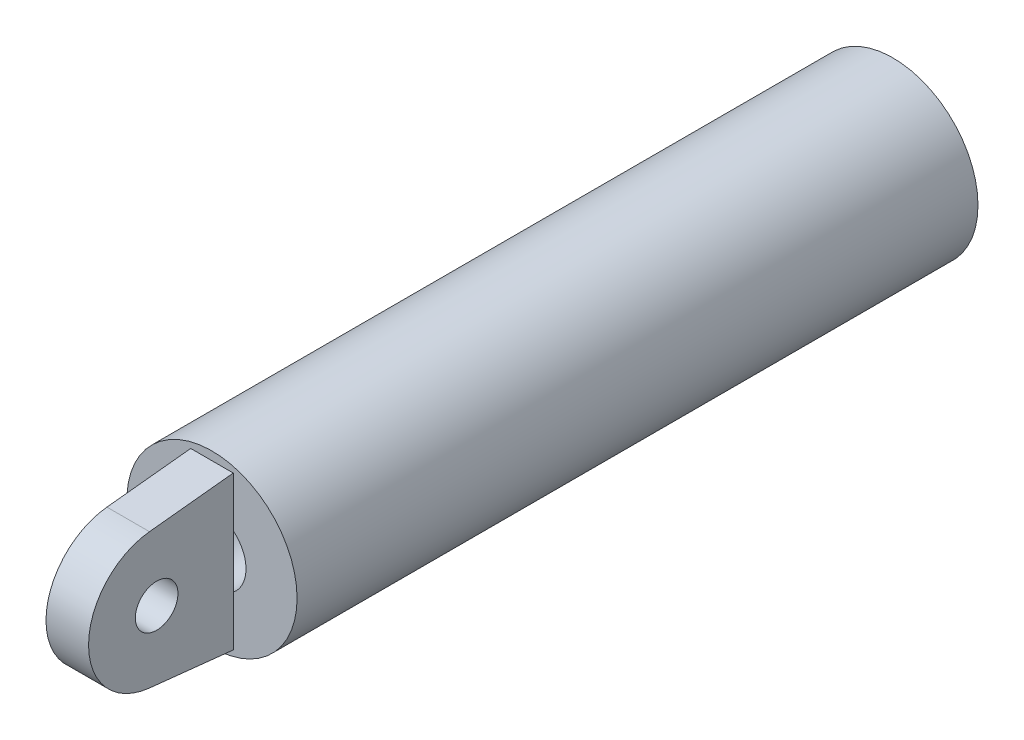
ISO-10303-21;
HEADER;
FILE_DESCRIPTION(('STEP AP214'),'2;1');
FILE_NAME('part.step','',(''),(''),'','','');
FILE_SCHEMA(('AUTOMOTIVE_DESIGN { 1 0 10303 214 1 1 1 1 }'));
ENDSEC;
DATA;
#1=APPLICATION_CONTEXT('core data for automotive mechanical design processes');
#2=APPLICATION_PROTOCOL_DEFINITION('international standard','automotive_design',2000,#1);
#3=PRODUCT_CONTEXT('',#1,'mechanical');
#4=PRODUCT('Part','Part','',(#3));
#5=PRODUCT_RELATED_PRODUCT_CATEGORY('part','',(#4));
#6=PRODUCT_DEFINITION_FORMATION('','',#4);
#7=PRODUCT_DEFINITION_CONTEXT('part definition',#1,'design');
#8=PRODUCT_DEFINITION('design','',#6,#7);
#9=PRODUCT_DEFINITION_SHAPE('','',#8);
#10=(LENGTH_UNIT() NAMED_UNIT(*) SI_UNIT(.MILLI.,.METRE.));
#11=(NAMED_UNIT(*) PLANE_ANGLE_UNIT() SI_UNIT($,.RADIAN.));
#12=(NAMED_UNIT(*) SI_UNIT($,.STERADIAN.) SOLID_ANGLE_UNIT());
#13=UNCERTAINTY_MEASURE_WITH_UNIT(LENGTH_MEASURE(1.E-05),#10,'distance_accuracy_value','');
#14=(GEOMETRIC_REPRESENTATION_CONTEXT(3) GLOBAL_UNCERTAINTY_ASSIGNED_CONTEXT((#13)) GLOBAL_UNIT_ASSIGNED_CONTEXT((#10,
#11,#12)) REPRESENTATION_CONTEXT('',''));
#15=CARTESIAN_POINT('',(0.,0.,0.));
#16=DIRECTION('',(0.,0.,1.));
#17=DIRECTION('',(1.,0.,0.));
#18=AXIS2_PLACEMENT_3D('',#15,#16,#17);
#19=CARTESIAN_POINT('',(0.,0.,400.));
#20=DIRECTION('',(0.,0.,1.));
#21=DIRECTION('',(1.,0.,0.));
#22=AXIS2_PLACEMENT_3D('',#19,#20,#21);
#23=PLANE('',#22);
#24=DIRECTION('',(0.,1.,0.));
#25=VECTOR('',#24,1.);
#26=CARTESIAN_POINT('',(12.5,-45.,400.));
#27=LINE('',#26,#25);
#28=CARTESIAN_POINT('',(12.5,-45.,400.));
#29=VERTEX_POINT('',#28);
#30=CARTESIAN_POINT('',(12.5,-15.612494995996,400.));
#31=VERTEX_POINT('',#30);
#32=EDGE_CURVE('E46',#29,#31,#27,.T.);
#33=ORIENTED_EDGE('',*,*,#32,.F.);
#34=DIRECTION('',(1.,0.,0.));
#35=VECTOR('',#34,1.);
#36=CARTESIAN_POINT('',(-12.5,-45.,400.));
#37=LINE('',#36,#35);
#38=CARTESIAN_POINT('',(-12.5,-45.,400.));
#39=VERTEX_POINT('',#38);
#40=EDGE_CURVE('E129',#39,#29,#37,.T.);
#41=ORIENTED_EDGE('',*,*,#40,.F.);
#42=DIRECTION('',(0.,1.,0.));
#43=VECTOR('',#42,1.);
#44=CARTESIAN_POINT('',(-12.5,-45.,400.));
#45=LINE('',#44,#43);
#46=CARTESIAN_POINT('',(-12.5,-15.612494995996,400.));
#47=VERTEX_POINT('',#46);
#48=EDGE_CURVE('E134',#39,#47,#45,.T.);
#49=ORIENTED_EDGE('',*,*,#48,.T.);
#50=CARTESIAN_POINT('',(0.,0.,400.));
#51=DIRECTION('',(0.,0.,1.));
#52=DIRECTION('',(1.,0.,0.));
#53=AXIS2_PLACEMENT_3D('',#50,#51,#52);
#54=CIRCLE('',#53,20.);
#55=CARTESIAN_POINT('',(-12.5,15.612494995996,400.));
#56=VERTEX_POINT('',#55);
#57=EDGE_CURVE('E125',#56,#47,#54,.T.);
#58=ORIENTED_EDGE('',*,*,#57,.F.);
#59=CARTESIAN_POINT('',(-12.5,45.,400.));
#60=VERTEX_POINT('',#59);
#61=EDGE_CURVE('E44',#56,#60,#45,.T.);
#62=ORIENTED_EDGE('',*,*,#61,.T.);
#63=DIRECTION('',(1.,0.,0.));
#64=VECTOR('',#63,1.);
#65=CARTESIAN_POINT('',(-12.5,45.,400.));
#66=LINE('',#65,#64);
#67=CARTESIAN_POINT('',(12.5,45.,400.));
#68=VERTEX_POINT('',#67);
#69=EDGE_CURVE('E105',#60,#68,#66,.T.);
#70=ORIENTED_EDGE('',*,*,#69,.T.);
#71=CARTESIAN_POINT('',(12.5,15.612494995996,400.));
#72=VERTEX_POINT('',#71);
#73=EDGE_CURVE('E11',#72,#68,#27,.T.);
#74=ORIENTED_EDGE('',*,*,#73,.F.);
#75=EDGE_CURVE('E126',#31,#72,#54,.T.);
#76=ORIENTED_EDGE('',*,*,#75,.F.);
#77=EDGE_LOOP('',(#33,#41,#49,#58,#62,#70,#74,#76));
#78=FACE_BOUND('',#77,.T.);
#79=CARTESIAN_POINT('',(0.,0.,400.));
#80=DIRECTION('',(0.,0.,1.));
#81=DIRECTION('',(1.,0.,0.));
#82=AXIS2_PLACEMENT_3D('',#79,#80,#81);
#83=CIRCLE('',#82,50.);
#84=CARTESIAN_POINT('',(50.,0.,400.));
#85=VERTEX_POINT('',#84);
#86=EDGE_CURVE('E130',#85,#85,#83,.T.);
#87=ORIENTED_EDGE('',*,*,#86,.T.);
#88=EDGE_LOOP('',(#87));
#89=FACE_BOUND('',#88,.T.);
#90=ADVANCED_FACE('F35',(#78,#89),#23,.T.);
#91=CARTESIAN_POINT('',(0.,0.,0.));
#92=DIRECTION('',(0.,0.,1.));
#93=DIRECTION('',(1.,0.,0.));
#94=AXIS2_PLACEMENT_3D('',#91,#92,#93);
#95=PLANE('',#94);
#96=CARTESIAN_POINT('',(0.,0.,0.));
#97=DIRECTION('',(0.,0.,1.));
#98=DIRECTION('',(1.,0.,0.));
#99=AXIS2_PLACEMENT_3D('',#96,#97,#98);
#100=CIRCLE('',#99,50.);
#101=CARTESIAN_POINT('',(50.,0.,0.));
#102=VERTEX_POINT('',#101);
#103=EDGE_CURVE('E39',#102,#102,#100,.T.);
#104=ORIENTED_EDGE('',*,*,#103,.F.);
#105=EDGE_LOOP('',(#104));
#106=FACE_BOUND('',#105,.T.);
#107=CARTESIAN_POINT('',(0.,0.,0.));
#108=DIRECTION('',(0.,0.,1.));
#109=DIRECTION('',(1.,0.,0.));
#110=AXIS2_PLACEMENT_3D('',#107,#108,#109);
#111=CIRCLE('',#110,20.);
#112=CARTESIAN_POINT('',(20.,0.,0.));
#113=VERTEX_POINT('',#112);
#114=EDGE_CURVE('E127',#113,#113,#111,.T.);
#115=ORIENTED_EDGE('',*,*,#114,.T.);
#116=EDGE_LOOP('',(#115));
#117=FACE_BOUND('',#116,.T.);
#118=ADVANCED_FACE('F139',(#106,#117),#95,.F.);
#119=CARTESIAN_POINT('',(0.,0.,400.));
#120=DIRECTION('',(0.,0.,-1.));
#121=DIRECTION('',(-1.,0.,0.));
#122=AXIS2_PLACEMENT_3D('',#119,#120,#121);
#123=CYLINDRICAL_SURFACE('',#122,50.);
#124=ORIENTED_EDGE('',*,*,#86,.F.);
#125=EDGE_LOOP('',(#124));
#126=FACE_BOUND('',#125,.T.);
#127=ORIENTED_EDGE('',*,*,#103,.T.);
#128=EDGE_LOOP('',(#127));
#129=FACE_BOUND('',#128,.T.);
#130=ADVANCED_FACE('F37',(#126,#129),#123,.T.);
#131=CARTESIAN_POINT('',(0.,0.,400.));
#132=DIRECTION('',(0.,0.,-1.));
#133=DIRECTION('',(-1.,0.,0.));
#134=AXIS2_PLACEMENT_3D('',#131,#132,#133);
#135=CYLINDRICAL_SURFACE('',#134,20.);
#136=EDGE_CURVE('E122',#72,#56,#54,.T.);
#137=ORIENTED_EDGE('',*,*,#136,.T.);
#138=ORIENTED_EDGE('',*,*,#57,.T.);
#139=EDGE_CURVE('E263',#47,#31,#54,.T.);
#140=ORIENTED_EDGE('',*,*,#139,.T.);
#141=ORIENTED_EDGE('',*,*,#75,.T.);
#142=EDGE_LOOP('',(#137,#138,#140,#141));
#143=FACE_BOUND('',#142,.T.);
#144=ORIENTED_EDGE('',*,*,#114,.F.);
#145=EDGE_LOOP('',(#144));
#146=FACE_BOUND('',#145,.T.);
#147=ADVANCED_FACE('F144',(#143,#146),#135,.F.);
#148=CARTESIAN_POINT('',(-12.5,-45.,400.));
#149=DIRECTION('',(0.,0.,-1.));
#150=DIRECTION('',(-1.,0.,0.));
#151=AXIS2_PLACEMENT_3D('',#148,#149,#150);
#152=PLANE('',#151);
#153=ORIENTED_EDGE('',*,*,#136,.F.);
#154=EDGE_CURVE('E47',#31,#72,#27,.T.);
#155=ORIENTED_EDGE('',*,*,#154,.F.);
#156=ORIENTED_EDGE('',*,*,#139,.F.);
#157=EDGE_CURVE('E60',#47,#56,#45,.T.);
#158=ORIENTED_EDGE('',*,*,#157,.T.);
#159=EDGE_LOOP('',(#153,#155,#156,#158));
#160=FACE_BOUND('',#159,.T.);
#161=ADVANCED_FACE('F146',(#160),#152,.T.);
#162=CARTESIAN_POINT('',(-12.5,-39.7766554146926,449.221099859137));
#163=DIRECTION('',(0.,-0.994416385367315,0.105527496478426));
#164=DIRECTION('',(0.,-0.105527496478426,-0.994416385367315));
#165=AXIS2_PLACEMENT_3D('',#162,#163,#164);
#166=PLANE('',#165);
#167=ORIENTED_EDGE('',*,*,#40,.T.);
#168=DIRECTION('',(0.,-0.105527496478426,-0.994416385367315));
#169=VECTOR('',#168,1.);
#170=CARTESIAN_POINT('',(12.5,-39.7766554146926,449.221099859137));
#171=LINE('',#170,#169);
#172=CARTESIAN_POINT('',(12.5,-39.7766554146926,449.221099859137));
#173=VERTEX_POINT('',#172);
#174=EDGE_CURVE('E250',#173,#29,#171,.T.);
#175=ORIENTED_EDGE('',*,*,#174,.F.);
#176=DIRECTION('',(1.,0.,0.));
#177=VECTOR('',#176,1.);
#178=CARTESIAN_POINT('',(-12.5,-39.7766554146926,449.221099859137));
#179=LINE('',#178,#177);
#180=CARTESIAN_POINT('',(-12.5,-39.7766554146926,449.221099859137));
#181=VERTEX_POINT('',#180);
#182=EDGE_CURVE('E115',#181,#173,#179,.T.);
#183=ORIENTED_EDGE('',*,*,#182,.F.);
#184=DIRECTION('',(0.,-0.105527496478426,-0.994416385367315));
#185=VECTOR('',#184,1.);
#186=CARTESIAN_POINT('',(-12.5,-39.7766554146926,449.221099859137));
#187=LINE('',#186,#185);
#188=EDGE_CURVE('E113',#181,#39,#187,.T.);
#189=ORIENTED_EDGE('',*,*,#188,.T.);
#190=EDGE_LOOP('',(#167,#175,#183,#189));
#191=FACE_BOUND('',#190,.T.);
#192=ADVANCED_FACE('F153',(#191),#166,.T.);
#193=CARTESIAN_POINT('',(-12.5,0.,445.));
#194=DIRECTION('',(1.,0.,0.));
#195=DIRECTION('',(0.,0.,-1.));
#196=AXIS2_PLACEMENT_3D('',#193,#194,#195);
#197=CYLINDRICAL_SURFACE('',#196,40.);
#198=ORIENTED_EDGE('',*,*,#182,.T.);
#199=CARTESIAN_POINT('',(12.5,0.,445.));
#200=DIRECTION('',(1.,0.,0.));
#201=DIRECTION('',(0.,0.,-1.));
#202=AXIS2_PLACEMENT_3D('',#199,#200,#201);
#203=CIRCLE('',#202,40.);
#204=CARTESIAN_POINT('',(12.5,39.7766554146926,449.221099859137));
#205=VERTEX_POINT('',#204);
#206=EDGE_CURVE('E108',#205,#173,#203,.T.);
#207=ORIENTED_EDGE('',*,*,#206,.F.);
#208=DIRECTION('',(1.,0.,0.));
#209=VECTOR('',#208,1.);
#210=CARTESIAN_POINT('',(-12.5,39.7766554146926,449.221099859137));
#211=LINE('',#210,#209);
#212=CARTESIAN_POINT('',(-12.5,39.7766554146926,449.221099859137));
#213=VERTEX_POINT('',#212);
#214=EDGE_CURVE('E107',#213,#205,#211,.T.);
#215=ORIENTED_EDGE('',*,*,#214,.F.);
#216=CARTESIAN_POINT('',(-12.5,0.,445.));
#217=DIRECTION('',(1.,0.,0.));
#218=DIRECTION('',(0.,0.,-1.));
#219=AXIS2_PLACEMENT_3D('',#216,#217,#218);
#220=CIRCLE('',#219,40.);
#221=EDGE_CURVE('E118',#213,#181,#220,.T.);
#222=ORIENTED_EDGE('',*,*,#221,.T.);
#223=EDGE_LOOP('',(#198,#207,#215,#222));
#224=FACE_BOUND('',#223,.T.);
#225=ADVANCED_FACE('F190',(#224),#197,.T.);
#226=CARTESIAN_POINT('',(-12.5,45.,400.));
#227=DIRECTION('',(0.,0.994416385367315,0.105527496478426));
#228=DIRECTION('',(0.,-0.105527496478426,0.994416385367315));
#229=AXIS2_PLACEMENT_3D('',#226,#227,#228);
#230=PLANE('',#229);
#231=ORIENTED_EDGE('',*,*,#214,.T.);
#232=DIRECTION('',(0.,-0.105527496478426,0.994416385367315));
#233=VECTOR('',#232,1.);
#234=CARTESIAN_POINT('',(12.5,45.,400.));
#235=LINE('',#234,#233);
#236=EDGE_CURVE('E97',#68,#205,#235,.T.);
#237=ORIENTED_EDGE('',*,*,#236,.F.);
#238=ORIENTED_EDGE('',*,*,#69,.F.);
#239=DIRECTION('',(0.,-0.105527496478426,0.994416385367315));
#240=VECTOR('',#239,1.);
#241=CARTESIAN_POINT('',(-12.5,45.,400.));
#242=LINE('',#241,#240);
#243=EDGE_CURVE('E54',#60,#213,#242,.T.);
#244=ORIENTED_EDGE('',*,*,#243,.T.);
#245=EDGE_LOOP('',(#231,#237,#238,#244));
#246=FACE_BOUND('',#245,.T.);
#247=ADVANCED_FACE('F104',(#246),#230,.T.);
#248=CARTESIAN_POINT('',(-12.5,0.,445.));
#249=DIRECTION('',(1.,0.,0.));
#250=DIRECTION('',(0.,0.,-1.));
#251=AXIS2_PLACEMENT_3D('',#248,#249,#250);
#252=PLANE('',#251);
#253=CARTESIAN_POINT('',(-12.5,0.,445.));
#254=DIRECTION('',(1.,0.,0.));
#255=DIRECTION('',(0.,0.,-1.));
#256=AXIS2_PLACEMENT_3D('',#253,#254,#255);
#257=CIRCLE('',#256,12.5);
#258=CARTESIAN_POINT('',(-12.5,0.,432.5));
#259=VERTEX_POINT('',#258);
#260=EDGE_CURVE('E243',#259,#259,#257,.T.);
#261=ORIENTED_EDGE('',*,*,#260,.T.);
#262=EDGE_LOOP('',(#261));
#263=FACE_BOUND('',#262,.T.);
#264=ORIENTED_EDGE('',*,*,#48,.F.);
#265=ORIENTED_EDGE('',*,*,#188,.F.);
#266=ORIENTED_EDGE('',*,*,#221,.F.);
#267=ORIENTED_EDGE('',*,*,#243,.F.);
#268=ORIENTED_EDGE('',*,*,#61,.F.);
#269=ORIENTED_EDGE('',*,*,#157,.F.);
#270=EDGE_LOOP('',(#264,#265,#266,#267,#268,#269));
#271=FACE_BOUND('',#270,.T.);
#272=ADVANCED_FACE('F207',(#263,#271),#252,.F.);
#273=CARTESIAN_POINT('',(-12.5,0.,445.));
#274=DIRECTION('',(1.,0.,0.));
#275=DIRECTION('',(0.,0.,-1.));
#276=AXIS2_PLACEMENT_3D('',#273,#274,#275);
#277=CYLINDRICAL_SURFACE('',#276,12.5);
#278=ORIENTED_EDGE('',*,*,#260,.F.);
#279=EDGE_LOOP('',(#278));
#280=FACE_BOUND('',#279,.T.);
#281=CARTESIAN_POINT('',(12.5,0.,445.));
#282=DIRECTION('',(1.,0.,0.));
#283=DIRECTION('',(0.,0.,-1.));
#284=AXIS2_PLACEMENT_3D('',#281,#282,#283);
#285=CIRCLE('',#284,12.5);
#286=CARTESIAN_POINT('',(12.5,0.,432.5));
#287=VERTEX_POINT('',#286);
#288=EDGE_CURVE('E246',#287,#287,#285,.T.);
#289=ORIENTED_EDGE('',*,*,#288,.T.);
#290=EDGE_LOOP('',(#289));
#291=FACE_BOUND('',#290,.T.);
#292=ADVANCED_FACE('F215',(#280,#291),#277,.F.);
#293=CARTESIAN_POINT('',(12.5,0.,445.));
#294=DIRECTION('',(1.,0.,0.));
#295=DIRECTION('',(0.,0.,-1.));
#296=AXIS2_PLACEMENT_3D('',#293,#294,#295);
#297=PLANE('',#296);
#298=ORIENTED_EDGE('',*,*,#32,.T.);
#299=ORIENTED_EDGE('',*,*,#154,.T.);
#300=ORIENTED_EDGE('',*,*,#73,.T.);
#301=ORIENTED_EDGE('',*,*,#236,.T.);
#302=ORIENTED_EDGE('',*,*,#206,.T.);
#303=ORIENTED_EDGE('',*,*,#174,.T.);
#304=EDGE_LOOP('',(#298,#299,#300,#301,#302,#303));
#305=FACE_BOUND('',#304,.T.);
#306=ORIENTED_EDGE('',*,*,#288,.F.);
#307=EDGE_LOOP('',(#306));
#308=FACE_BOUND('',#307,.T.);
#309=ADVANCED_FACE('F94',(#305,#308),#297,.T.);
#310=CLOSED_SHELL('',(#90,#118,#130,#147,#161,#192,#225,#247,#272,#292,#309));
#311=MANIFOLD_SOLID_BREP('B2',#310);
#312=ADVANCED_BREP_SHAPE_REPRESENTATION('',(#18,#311),#14);
#313=SHAPE_DEFINITION_REPRESENTATION(#9,#312);
ENDSEC;
END-ISO-10303-21;
